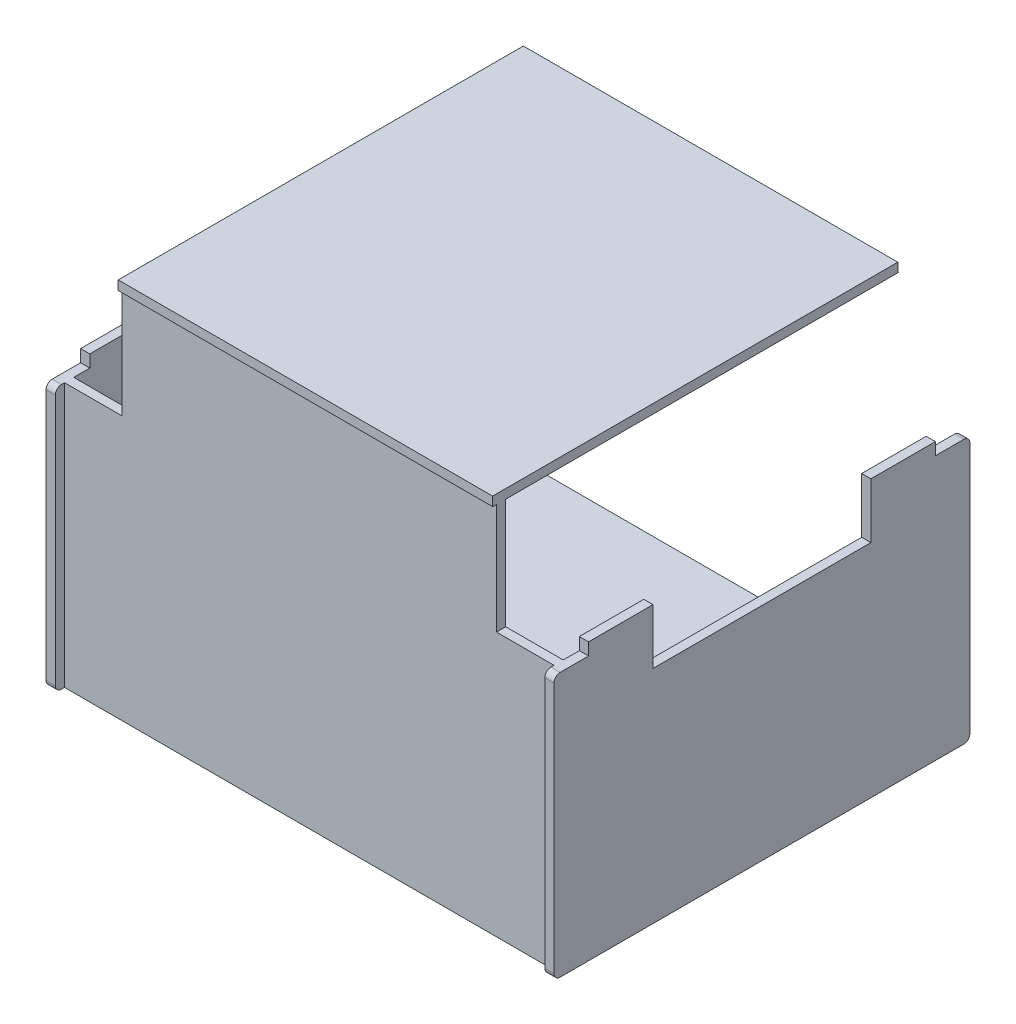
from build123d import *

# Parameters (mm, degrees)
BOSS_EXTRUDE1_DEPTH       = 135.5
SHELL1_T                  = -12
SHELL1_THICKNESS_2_FACE_W = 259
SHELL1_THICKNESS_2_FACE_H = 244
SHELL1_THICKNESS_2_DEPTH  = 6
SHELL1_THICKNESS_3_FACE_W = 160
SHELL1_THICKNESS_3_FACE_H = 259
SHELL1_THICKNESS_3_DEPTH  = 6
SHELL1_THICKNESS_4_FACE_W = 259
SHELL1_THICKNESS_4_FACE_H = 160
SHELL1_THICKNESS_4_DEPTH  = 6
SKETCH2_W                 = 142
SKETCH2_H                 = 28
CUT_EXTRUDE1_DEPTH        = 437.37283371
SKETCH3_W                 = 319
SKETCH3_H                 = 6
CUT_EXTRUDE2_DEPTH        = 330.014437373
SKETCH4_W                 = 244
SKETCH4_H                 = 6
BOSS_EXTRUDE2_DEPTH       = 2.5
CUT_EXTRUDE3_START        = -6
SKETCH5_W                 = 319
SKETCH5_H                 = 6
CUT_EXTRUDE3_DEPTH        = 395.144036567
SKETCH6_W                 = 6
SKETCH6_H                 = 42
BOSS_EXTRUDE3_DEPTH       = 8
FILLET1_R                 = 4
MOVE_FACE1_BY             = 3.5


with BuildPart() as part:
    # Sketch1 → Boss-Extrude1 (new, symmetric)
    with BuildSketch(Plane.XY):
        Polygon((-122, 0), (122, 0), (122, -78), (165.5, -78), (165.5, -250), (-165.5, -250), (-165.5, -78), (-122, -78), align=None)
    extrude(amount=BOSS_EXTRUDE1_DEPTH, both=True)

    # Shell1
    shell1_openings = [part.faces().sort_by_distance(p)[0] for p in [
        (122, -39, 0),
        (143.75, -78, 0),
        (-143.75, -78, 0),
        (-122, -39, 0),
        (0, -132.682533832, -135.5),
    ]]
    offset(amount=SHELL1_T, openings=shell1_openings, kind=Kind.INTERSECTION)

    # Shell1 thickness 2 face (on inner face of the shell) → Shell1 thickness 2 (cut)
    with BuildSketch(Plane(origin=(0, -12, -6), x_dir=(0, 0, 1), z_dir=(0, 1, 0))):
        Rectangle(SHELL1_THICKNESS_2_FACE_W, SHELL1_THICKNESS_2_FACE_H)
    extrude(amount=SHELL1_THICKNESS_2_DEPTH, mode=Mode.SUBTRACT)

    # Shell1 thickness 3 face (on inner face of the shell) → Shell1 thickness 3 (cut)
    with BuildSketch(Plane(origin=(153.5, -158, -6), x_dir=(0, 1, 0), z_dir=(1, 0, 0))):
        Rectangle(SHELL1_THICKNESS_3_FACE_W, SHELL1_THICKNESS_3_FACE_H)
    extrude(amount=SHELL1_THICKNESS_3_DEPTH, mode=Mode.SUBTRACT)

    # Shell1 thickness 4 face (on inner face of the shell) → Shell1 thickness 4 (cut)
    with BuildSketch(Plane(origin=(-153.5, -158, -6), x_dir=(0, 0, -1), z_dir=(-1, 0, 0))):
        Rectangle(SHELL1_THICKNESS_4_FACE_W, SHELL1_THICKNESS_4_FACE_H)
    extrude(amount=SHELL1_THICKNESS_4_DEPTH, mode=Mode.SUBTRACT)

    # Sketch2 → Cut-Extrude1 (cut, through all)
    with BuildSketch(Plane(origin=(165.5, 0, 0), x_dir=(0, 0, -1), z_dir=(1, 0, 0))):
        with Locations((0, -92)):
            Rectangle(SKETCH2_W, SKETCH2_H)
    extrude(amount=-CUT_EXTRUDE1_DEPTH, mode=Mode.SUBTRACT)

    # Sketch3 → Cut-Extrude2 (cut, through all)
    with BuildSketch(Plane.XZ.offset(250)):
        with Locations((0, 132.5)):
            Rectangle(SKETCH3_W, SKETCH3_H)
    extrude(amount=-CUT_EXTRUDE2_DEPTH, mode=Mode.SUBTRACT)

    # Sketch4 → Boss-Extrude2 (add)
    with BuildSketch(Plane.XY.offset(129.5)):
        with Locations((0, -3)):
            Rectangle(SKETCH4_W, SKETCH4_H)
    extrude(amount=BOSS_EXTRUDE2_DEPTH)

    # Sketch5 → Cut-Extrude3 (cut, through all)
    with BuildSketch(Plane.XY.offset(129.5).offset(CUT_EXTRUDE3_START)):
        with Locations((0, -247)):
            Rectangle(SKETCH5_W, SKETCH5_H)
    extrude(amount=-CUT_EXTRUDE3_DEPTH, mode=Mode.SUBTRACT)

    # Sketch6 → Boss-Extrude3 (add)
    with BuildSketch(Plane(origin=(0, -78, 0), x_dir=(1, 0, 0), z_dir=(0, 1, 0))):
        with Locations((162.5, -92)):
            Rectangle(SKETCH6_W, SKETCH6_H)
        with Locations((162.5, 92)):
            Rectangle(SKETCH6_W, SKETCH6_H)
        with Locations((-162.5, -92)):
            Rectangle(SKETCH6_W, SKETCH6_H)
        with Locations((-162.5, 92)):
            Rectangle(SKETCH6_W, SKETCH6_H)
    extrude(amount=BOSS_EXTRUDE3_DEPTH)

    # Fillet1
    fillet1_edges = [part.edges().sort_by_distance(p)[0] for p in [
        (-162.5, -78, -135.5),
        (162.5, -250, -135.5),
        (-162.5, -250, 135.5),
        (162.5, -78, 135.5),
        (-162.5, -78, 135.5),
        (162.5, -250, 135.5),
        (162.5, -78, -135.5),
        (-162.5, -250, -135.5),
    ]]
    fillet(fillet1_edges, radius=FILLET1_R)

    # Move Face1: a face moved inward by 3.5
    extrude(part.faces().sort_by_distance((0, -3, -135.5))[0], amount=MOVE_FACE1_BY, dir=(0, 0, 1), mode=Mode.SUBTRACT)


solid = part.part
